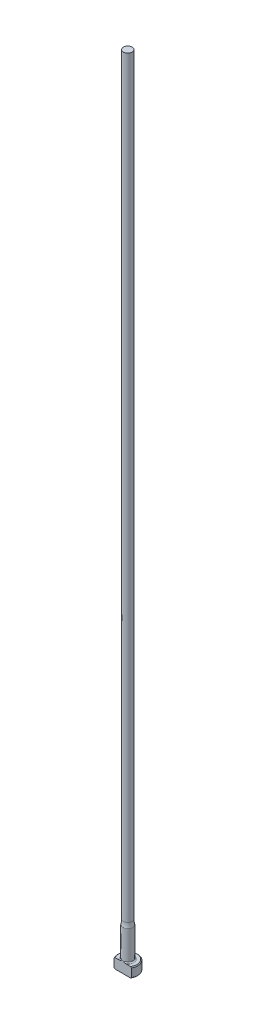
ISO-10303-21;
HEADER;
FILE_DESCRIPTION(('STEP AP214'),'2;1');
FILE_NAME('part.step','',(''),(''),'','','');
FILE_SCHEMA(('AUTOMOTIVE_DESIGN { 1 0 10303 214 1 1 1 1 }'));
ENDSEC;
DATA;
#1=APPLICATION_CONTEXT('core data for automotive mechanical design processes');
#2=APPLICATION_PROTOCOL_DEFINITION('international standard','automotive_design',2000,#1);
#3=PRODUCT_CONTEXT('',#1,'mechanical');
#4=PRODUCT('Part','Part','',(#3));
#5=PRODUCT_RELATED_PRODUCT_CATEGORY('part','',(#4));
#6=PRODUCT_DEFINITION_FORMATION('','',#4);
#7=PRODUCT_DEFINITION_CONTEXT('part definition',#1,'design');
#8=PRODUCT_DEFINITION('design','',#6,#7);
#9=PRODUCT_DEFINITION_SHAPE('','',#8);
#10=(LENGTH_UNIT() NAMED_UNIT(*) SI_UNIT(.MILLI.,.METRE.));
#11=(NAMED_UNIT(*) PLANE_ANGLE_UNIT() SI_UNIT($,.RADIAN.));
#12=(NAMED_UNIT(*) SI_UNIT($,.STERADIAN.) SOLID_ANGLE_UNIT());
#13=UNCERTAINTY_MEASURE_WITH_UNIT(LENGTH_MEASURE(1.E-05),#10,'distance_accuracy_value','');
#14=(GEOMETRIC_REPRESENTATION_CONTEXT(3) GLOBAL_UNCERTAINTY_ASSIGNED_CONTEXT((#13)) GLOBAL_UNIT_ASSIGNED_CONTEXT((#10,
#11,#12)) REPRESENTATION_CONTEXT('',''));
#15=CARTESIAN_POINT('',(0.,0.,0.));
#16=DIRECTION('',(0.,0.,1.));
#17=DIRECTION('',(1.,0.,0.));
#18=AXIS2_PLACEMENT_3D('',#15,#16,#17);
#19=CARTESIAN_POINT('',(-1.38810999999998,254.,0.));
#20=DIRECTION('',(0.,1.,0.));
#21=DIRECTION('',(0.,0.,1.));
#22=AXIS2_PLACEMENT_3D('',#19,#20,#21);
#23=PLANE('',#22);
#24=CARTESIAN_POINT('',(0.,254.,0.));
#25=DIRECTION('',(0.,1.,0.));
#26=DIRECTION('',(0.,0.,1.));
#27=AXIS2_PLACEMENT_3D('',#24,#25,#26);
#28=CIRCLE('',#27,1.38810999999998);
#29=CARTESIAN_POINT('',(0.,254.,1.38810999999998));
#30=VERTEX_POINT('',#29);
#31=EDGE_CURVE('E164',#30,#30,#28,.T.);
#32=ORIENTED_EDGE('',*,*,#31,.T.);
#33=EDGE_LOOP('',(#32));
#34=FACE_BOUND('',#33,.T.);
#35=ADVANCED_FACE('F32',(#34),#23,.T.);
#36=CARTESIAN_POINT('',(0.,259.958771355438,0.));
#37=DIRECTION('',(0.,1.,0.));
#38=DIRECTION('',(0.,0.,1.));
#39=AXIS2_PLACEMENT_3D('',#36,#37,#38);
#40=CYLINDRICAL_SURFACE('',#39,1.38810999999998);
#41=CARTESIAN_POINT('',(0.,14.2787642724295,0.));
#42=DIRECTION('',(0.,1.,0.));
#43=DIRECTION('',(0.,0.,1.));
#44=AXIS2_PLACEMENT_3D('',#41,#42,#43);
#45=CIRCLE('',#44,1.38810999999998);
#46=CARTESIAN_POINT('',(0.,14.2787642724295,1.38810999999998));
#47=VERTEX_POINT('',#46);
#48=EDGE_CURVE('E167',#47,#47,#45,.T.);
#49=ORIENTED_EDGE('',*,*,#48,.T.);
#50=EDGE_LOOP('',(#49));
#51=FACE_BOUND('',#50,.T.);
#52=ORIENTED_EDGE('',*,*,#31,.F.);
#53=EDGE_LOOP('',(#52));
#54=FACE_BOUND('',#53,.T.);
#55=ADVANCED_FACE('F155',(#51,#54),#40,.T.);
#56=CARTESIAN_POINT('',(0.,14.2787642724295,0.));
#57=DIRECTION('',(0.,1.,0.));
#58=DIRECTION('',(0.,0.,1.));
#59=AXIS2_PLACEMENT_3D('',#56,#57,#58);
#60=TOROIDAL_SURFACE('',#59,7.73810999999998,6.35);
#61=CARTESIAN_POINT('',(0.,12.7,0.));
#62=DIRECTION('',(0.,1.,0.));
#63=DIRECTION('',(0.,0.,1.));
#64=AXIS2_PLACEMENT_3D('',#61,#62,#63);
#65=CIRCLE('',#64,1.58749999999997);
#66=CARTESIAN_POINT('',(0.,12.7,1.58749999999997));
#67=VERTEX_POINT('',#66);
#68=EDGE_CURVE('E95',#67,#67,#65,.T.);
#69=ORIENTED_EDGE('',*,*,#68,.T.);
#70=EDGE_LOOP('',(#69));
#71=FACE_BOUND('',#70,.T.);
#72=ORIENTED_EDGE('',*,*,#48,.F.);
#73=EDGE_LOOP('',(#72));
#74=FACE_BOUND('',#73,.T.);
#75=ADVANCED_FACE('F160',(#71,#74),#60,.F.);
#76=CARTESIAN_POINT('',(0.,259.958771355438,0.));
#77=DIRECTION('',(0.,1.,0.));
#78=DIRECTION('',(0.,0.,1.));
#79=AXIS2_PLACEMENT_3D('',#76,#77,#78);
#80=CYLINDRICAL_SURFACE('',#79,1.58749999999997);
#81=CARTESIAN_POINT('',(0.,3.556,0.));
#82=DIRECTION('',(0.,1.,0.));
#83=DIRECTION('',(0.,0.,1.));
#84=AXIS2_PLACEMENT_3D('',#81,#82,#83);
#85=CIRCLE('',#84,1.58749999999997);
#86=CARTESIAN_POINT('',(0.,3.556,1.58749999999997));
#87=VERTEX_POINT('',#86);
#88=EDGE_CURVE('E104',#87,#87,#85,.T.);
#89=ORIENTED_EDGE('',*,*,#88,.T.);
#90=EDGE_LOOP('',(#89));
#91=FACE_BOUND('',#90,.T.);
#92=ORIENTED_EDGE('',*,*,#68,.F.);
#93=EDGE_LOOP('',(#92));
#94=FACE_BOUND('',#93,.T.);
#95=ADVANCED_FACE('F187',(#91,#94),#80,.T.);
#96=CARTESIAN_POINT('',(-3.17499999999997,3.175,0.));
#97=DIRECTION('',(0.,1.,0.));
#98=DIRECTION('',(0.,0.,1.));
#99=AXIS2_PLACEMENT_3D('',#96,#97,#98);
#100=PLANE('',#99);
#101=DIRECTION('',(-1.,0.,0.));
#102=VECTOR('',#101,1.);
#103=CARTESIAN_POINT('',(-3.17499999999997,3.175,1.58749999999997));
#104=LINE('',#103,#102);
#105=CARTESIAN_POINT('',(2.45195529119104,3.175,1.58749999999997));
#106=VERTEX_POINT('',#105);
#107=CARTESIAN_POINT('',(1.16397422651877,3.175,1.58749999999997));
#108=VERTEX_POINT('',#107);
#109=EDGE_CURVE('E53',#106,#108,#104,.T.);
#110=ORIENTED_EDGE('',*,*,#109,.F.);
#111=CARTESIAN_POINT('',(0.,3.175,0.));
#112=DIRECTION('',(0.,1.,0.));
#113=DIRECTION('',(0.,0.,1.));
#114=AXIS2_PLACEMENT_3D('',#111,#112,#113);
#115=CIRCLE('',#114,2.92099999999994);
#116=CARTESIAN_POINT('',(-2.45195529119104,3.175,1.58749999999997));
#117=VERTEX_POINT('',#116);
#118=EDGE_CURVE('E166',#106,#117,#115,.T.);
#119=ORIENTED_EDGE('',*,*,#118,.T.);
#120=CARTESIAN_POINT('',(-1.16397422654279,3.175,1.58749999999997));
#121=VERTEX_POINT('',#120);
#122=EDGE_CURVE('E135',#121,#117,#104,.T.);
#123=ORIENTED_EDGE('',*,*,#122,.F.);
#124=CARTESIAN_POINT('',(0.,3.175,0.));
#125=DIRECTION('',(0.,1.,0.));
#126=DIRECTION('',(0.,0.,1.));
#127=AXIS2_PLACEMENT_3D('',#124,#125,#126);
#128=CIRCLE('',#127,1.96849999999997);
#129=EDGE_CURVE('E108',#121,#108,#128,.F.);
#130=ORIENTED_EDGE('',*,*,#129,.T.);
#131=EDGE_LOOP('',(#110,#119,#123,#130));
#132=FACE_BOUND('',#131,.T.);
#133=ADVANCED_FACE('F184',(#132),#100,.T.);
#134=CARTESIAN_POINT('',(0.,259.958771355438,0.));
#135=DIRECTION('',(0.,1.,0.));
#136=DIRECTION('',(0.,0.,1.));
#137=AXIS2_PLACEMENT_3D('',#134,#135,#136);
#138=CYLINDRICAL_SURFACE('',#137,3.17499999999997);
#139=DIRECTION('',(0.,-1.,0.));
#140=VECTOR('',#139,1.);
#141=CARTESIAN_POINT('',(-2.74963065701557,254.,1.58749999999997));
#142=LINE('',#141,#140);
#143=CARTESIAN_POINT('',(-2.74963065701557,2.92100000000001,1.58749999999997));
#144=VERTEX_POINT('',#143);
#145=CARTESIAN_POINT('',(-2.74963065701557,0.253999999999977,1.58749999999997));
#146=VERTEX_POINT('',#145);
#147=EDGE_CURVE('E90',#144,#146,#142,.T.);
#148=ORIENTED_EDGE('',*,*,#147,.F.);
#149=CARTESIAN_POINT('',(0.,2.92100000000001,0.));
#150=DIRECTION('',(0.,1.,0.));
#151=DIRECTION('',(0.,0.,1.));
#152=AXIS2_PLACEMENT_3D('',#149,#150,#151);
#153=CIRCLE('',#152,3.17499999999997);
#154=CARTESIAN_POINT('',(2.74963065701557,2.92100000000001,1.58749999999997));
#155=VERTEX_POINT('',#154);
#156=EDGE_CURVE('E105',#144,#155,#153,.F.);
#157=ORIENTED_EDGE('',*,*,#156,.T.);
#158=DIRECTION('',(0.,-1.,0.));
#159=VECTOR('',#158,1.);
#160=CARTESIAN_POINT('',(2.74963065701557,254.,1.58749999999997));
#161=LINE('',#160,#159);
#162=CARTESIAN_POINT('',(2.74963065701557,0.253999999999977,1.58749999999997));
#163=VERTEX_POINT('',#162);
#164=EDGE_CURVE('E177',#155,#163,#161,.T.);
#165=ORIENTED_EDGE('',*,*,#164,.T.);
#166=CARTESIAN_POINT('',(0.,0.253999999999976,0.));
#167=DIRECTION('',(0.,-1.,0.));
#168=DIRECTION('',(0.,0.,-1.));
#169=AXIS2_PLACEMENT_3D('',#166,#167,#168);
#170=CIRCLE('',#169,3.17499999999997);
#171=EDGE_CURVE('E111',#163,#146,#170,.F.);
#172=ORIENTED_EDGE('',*,*,#171,.T.);
#173=EDGE_LOOP('',(#148,#157,#165,#172));
#174=FACE_BOUND('',#173,.T.);
#175=ADVANCED_FACE('F175',(#174),#138,.T.);
#176=CARTESIAN_POINT('',(0.,0.,0.));
#177=DIRECTION('',(0.,-1.,0.));
#178=DIRECTION('',(0.,0.,-1.));
#179=AXIS2_PLACEMENT_3D('',#176,#177,#178);
#180=PLANE('',#179);
#181=DIRECTION('',(1.,0.,0.));
#182=VECTOR('',#181,1.);
#183=CARTESIAN_POINT('',(-2.74963065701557,0.,1.58749999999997));
#184=LINE('',#183,#182);
#185=CARTESIAN_POINT('',(-2.45195529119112,0.,1.58749999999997));
#186=VERTEX_POINT('',#185);
#187=CARTESIAN_POINT('',(2.45195529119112,0.,1.58749999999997));
#188=VERTEX_POINT('',#187);
#189=EDGE_CURVE('E87',#186,#188,#184,.T.);
#190=ORIENTED_EDGE('',*,*,#189,.F.);
#191=CARTESIAN_POINT('',(0.,0.,0.));
#192=DIRECTION('',(0.,-1.,0.));
#193=DIRECTION('',(0.,0.,-1.));
#194=AXIS2_PLACEMENT_3D('',#191,#192,#193);
#195=CIRCLE('',#194,2.92100000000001);
#196=EDGE_CURVE('E101',#186,#188,#195,.T.);
#197=ORIENTED_EDGE('',*,*,#196,.T.);
#198=EDGE_LOOP('',(#190,#197));
#199=FACE_BOUND('',#198,.T.);
#200=ADVANCED_FACE('F100',(#199),#180,.T.);
#201=CARTESIAN_POINT('',(0.,3.17499999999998,0.));
#202=DIRECTION('',(0.,-1.,0.));
#203=DIRECTION('',(0.,0.,-1.));
#204=AXIS2_PLACEMENT_3D('',#201,#202,#203);
#205=CONICAL_SURFACE('',#204,2.92099999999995,0.785398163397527);
#206=CARTESIAN_POINT('',(6.0529050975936,-0.16162066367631,1.58749999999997));
#207=CARTESIAN_POINT('',(5.91567682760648,-0.0288893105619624,1.58749999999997));
#208=CARTESIAN_POINT('',(5.7783103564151,0.103699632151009,1.58749999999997));
#209=CARTESIAN_POINT('',(5.50321874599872,0.368508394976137,1.58749999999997));
#210=CARTESIAN_POINT('',(5.36549360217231,0.500728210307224,1.58749999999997));
#211=CARTESIAN_POINT('',(5.08953516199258,0.764778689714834,1.58749999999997));
#212=CARTESIAN_POINT('',(4.9513016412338,0.896609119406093,1.58749999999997));
#213=CARTESIAN_POINT('',(4.67428233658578,1.15968706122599,1.58749999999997));
#214=CARTESIAN_POINT('',(4.53549655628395,1.29093457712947,1.58749999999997));
#215=CARTESIAN_POINT('',(4.25997724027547,1.55007705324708,1.58749999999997));
#216=CARTESIAN_POINT('',(4.12325766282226,1.67798684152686,1.58749999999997));
#217=CARTESIAN_POINT('',(3.84892898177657,1.9328486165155,1.58749999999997));
#218=CARTESIAN_POINT('',(3.71131988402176,2.05980060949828,1.58749999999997));
#219=CARTESIAN_POINT('',(3.43493978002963,2.31237508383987,1.58749999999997));
#220=CARTESIAN_POINT('',(3.29616903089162,2.43799784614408,1.58749999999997));
#221=CARTESIAN_POINT('',(3.01699558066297,2.68741369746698,1.58749999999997));
#222=CARTESIAN_POINT('',(2.8765929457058,2.81120686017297,1.58749999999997));
#223=CARTESIAN_POINT('',(2.64816703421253,3.00875865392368,1.58749999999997));
#224=CARTESIAN_POINT('',(2.56087478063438,3.08336151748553,1.58749999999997));
#225=CARTESIAN_POINT('',(2.38515423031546,3.23123871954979,1.58749999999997));
#226=CARTESIAN_POINT('',(2.29672582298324,3.30451292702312,1.58749999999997));
#227=CARTESIAN_POINT('',(2.11747400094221,3.45004422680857,1.58749999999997));
#228=CARTESIAN_POINT('',(2.02663514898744,3.5222823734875,1.58749999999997));
#229=CARTESIAN_POINT('',(1.8430252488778,3.66423097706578,1.58749999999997));
#230=CARTESIAN_POINT('',(1.75025467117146,3.73394203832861,1.58749999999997));
#231=CARTESIAN_POINT('',(1.56067475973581,3.87080633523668,1.58749999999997));
#232=CARTESIAN_POINT('',(1.46382547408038,3.93790459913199,1.58749999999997));
#233=CARTESIAN_POINT('',(1.26632594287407,4.06669147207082,1.58749999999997));
#234=CARTESIAN_POINT('',(1.16567073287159,4.1283726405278,1.58749999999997));
#235=CARTESIAN_POINT('',(1.01165766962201,4.21402252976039,1.58749999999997));
#236=CARTESIAN_POINT('',(0.960142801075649,4.24127929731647,1.58749999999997));
#237=CARTESIAN_POINT('',(0.855780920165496,4.2930979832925,1.58749999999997));
#238=CARTESIAN_POINT('',(0.80293366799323,4.31765941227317,1.58749999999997));
#239=CARTESIAN_POINT('',(0.642461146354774,4.38614656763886,1.58749999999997));
#240=CARTESIAN_POINT('',(0.532518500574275,4.42510149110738,1.58749999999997));
#241=CARTESIAN_POINT('',(0.367680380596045,4.46726244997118,1.58749999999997));
#242=CARTESIAN_POINT('',(0.31480288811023,4.47844427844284,1.58749999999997));
#243=CARTESIAN_POINT('',(0.208209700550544,4.49576654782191,1.58749999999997));
#244=CARTESIAN_POINT('',(0.154494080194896,4.50190743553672,1.58749999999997));
#245=CARTESIAN_POINT('',(0.0468792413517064,4.50871296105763,1.58749999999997));
#246=CARTESIAN_POINT('',(-0.0070188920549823,4.5093945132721,1.58749999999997));
#247=CARTESIAN_POINT('',(-0.114606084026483,4.50527679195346,1.58749999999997));
#248=CARTESIAN_POINT('',(-0.168295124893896,4.50047706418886,1.58749999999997));
#249=CARTESIAN_POINT('',(-0.274485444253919,4.48579689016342,1.58749999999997));
#250=CARTESIAN_POINT('',(-0.326992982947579,4.47596081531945,1.58749999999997));
#251=CARTESIAN_POINT('',(-0.430974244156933,4.45181809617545,1.58749999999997));
#252=CARTESIAN_POINT('',(-0.482447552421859,4.4375096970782,1.58749999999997));
#253=CARTESIAN_POINT('',(-0.584460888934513,4.40502489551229,1.58749999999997));
#254=CARTESIAN_POINT('',(-0.634994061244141,4.386827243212,1.58749999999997));
#255=CARTESIAN_POINT('',(-0.734789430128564,4.34729308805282,1.58749999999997));
#256=CARTESIAN_POINT('',(-0.784051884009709,4.3259572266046,1.58749999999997));
#257=CARTESIAN_POINT('',(-0.930549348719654,4.25791922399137,1.58749999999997));
#258=CARTESIAN_POINT('',(-1.0259880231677,4.20736047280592,1.58749999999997));
#259=CARTESIAN_POINT('',(-1.21304313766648,4.0995545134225,1.58749999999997));
#260=CARTESIAN_POINT('',(-1.30465471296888,4.04229912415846,1.58749999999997));
#261=CARTESIAN_POINT('',(-1.48526211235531,3.92308746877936,1.58749999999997));
#262=CARTESIAN_POINT('',(-1.57424615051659,3.86111349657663,1.58749999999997));
#263=CARTESIAN_POINT('',(-1.74990003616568,3.73408621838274,1.58749999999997));
#264=CARTESIAN_POINT('',(-1.83657099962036,3.66903444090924,1.58749999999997));
#265=CARTESIAN_POINT('',(-2.00931764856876,3.53583371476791,1.58749999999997));
#266=CARTESIAN_POINT('',(-2.09537048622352,3.46765527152,1.58749999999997));
#267=CARTESIAN_POINT('',(-2.26611736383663,3.32960643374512,1.58749999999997));
#268=CARTESIAN_POINT('',(-2.35081125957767,3.25973586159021,1.58749999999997));
#269=CARTESIAN_POINT('',(-2.60290121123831,3.04858139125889,1.58749999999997));
#270=CARTESIAN_POINT('',(-2.76872537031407,2.90542388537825,1.58749999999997));
#271=CARTESIAN_POINT('',(-3.06970913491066,2.64069522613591,1.58749999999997));
#272=CARTESIAN_POINT('',(-3.20528660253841,2.51959458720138,1.58749999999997));
#273=CARTESIAN_POINT('',(-3.47510321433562,2.27590400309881,1.58749999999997));
#274=CARTESIAN_POINT('',(-3.60934232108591,2.1533140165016,1.58749999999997));
#275=CARTESIAN_POINT('',(-3.87695374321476,1.90694239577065,1.58749999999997));
#276=CARTESIAN_POINT('',(-4.0103251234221,1.78315974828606,1.58749999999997));
#277=CARTESIAN_POINT('',(-4.27630880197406,1.53478104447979,1.58749999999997));
#278=CARTESIAN_POINT('',(-4.40892109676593,1.41018498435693,1.58749999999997));
#279=CARTESIAN_POINT('',(-4.79499418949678,1.0457468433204,1.58749999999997));
#280=CARTESIAN_POINT('',(-5.04767313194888,0.805076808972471,1.58749999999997));
#281=CARTESIAN_POINT('',(-5.42550911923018,0.443121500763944,1.58749999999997));
#282=CARTESIAN_POINT('',(-5.55118772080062,0.322378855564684,1.58749999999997));
#283=CARTESIAN_POINT('',(-5.80225207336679,0.0805914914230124,1.58749999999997));
#284=CARTESIAN_POINT('',(-5.92763782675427,-0.0404532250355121,1.58749999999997));
#285=CARTESIAN_POINT('',(-6.0529050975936,-0.161620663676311,1.58749999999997));
#286=B_SPLINE_CURVE_WITH_KNOTS('',3,(#206,#207,#208,#209,#210,#211,#212,#213,#214,#215,#216,
#217,#218,#219,#220,#221,#222,#223,#224,#225,#226,#227,#228,#229,#230,#231,#232,#233,#234,#235,
#236,#237,#238,#239,#240,#241,#242,#243,#244,#245,#246,#247,#248,#249,#250,#251,#252,#253,#254,
#255,#256,#257,#258,#259,#260,#261,#262,#263,#264,#265,#266,#267,#268,#269,#270,#271,#272,#273,
#274,#275,#276,#277,#278,#279,#280,#281,#282,#283,#284,#285),.UNSPECIFIED.,.F.,.F.,(4,2,2,2,2,2,
2,2,2,2,2,2,2,2,2,2,2,2,2,2,2,2,2,2,2,2,2,2,2,2,2,2,2,2,2,2,2,2,2,4),(0.,0.572750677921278,
1.14550874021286,1.71856057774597,2.29160869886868,2.85328006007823,3.4149477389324,
3.97649423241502,4.53801804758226,4.88249307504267,5.22700189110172,5.5751532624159,
5.92322081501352,6.27657800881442,6.63041319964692,6.80518126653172,6.9799810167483,
7.3282426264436,7.49018491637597,7.65211285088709,7.81353889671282,7.97497832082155,
8.13501929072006,8.29512313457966,8.45612518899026,8.61709438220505,8.94062993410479,
9.2645649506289,9.58978187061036,9.91483894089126,10.2441741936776,10.5735441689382,
11.2306812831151,11.7760337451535,12.3214014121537,12.8672825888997,13.4131663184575,
14.4600164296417,14.9828595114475,15.5056983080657),.UNSPECIFIED.);
#287=EDGE_CURVE('E58',#155,#106,#286,.T.);
#288=ORIENTED_EDGE('',*,*,#287,.F.);
#289=ORIENTED_EDGE('',*,*,#156,.F.);
#290=EDGE_CURVE('E128',#117,#144,#286,.T.);
#291=ORIENTED_EDGE('',*,*,#290,.F.);
#292=ORIENTED_EDGE('',*,*,#118,.F.);
#293=EDGE_LOOP('',(#288,#289,#291,#292));
#294=FACE_BOUND('',#293,.T.);
#295=ADVANCED_FACE('F142',(#294),#205,.T.);
#296=CARTESIAN_POINT('',(0.,0.253999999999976,0.));
#297=DIRECTION('',(0.,1.,0.));
#298=DIRECTION('',(0.,0.,1.));
#299=AXIS2_PLACEMENT_3D('',#296,#297,#298);
#300=CONICAL_SURFACE('',#299,3.17499999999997,0.785398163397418);
#301=CARTESIAN_POINT('',(-6.0529050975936,3.33662066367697,1.58749999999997));
#302=CARTESIAN_POINT('',(-5.91567682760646,3.20388931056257,1.58749999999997));
#303=CARTESIAN_POINT('',(-5.77831035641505,3.07130036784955,1.58749999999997));
#304=CARTESIAN_POINT('',(-5.50321874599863,2.80649160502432,1.58749999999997));
#305=CARTESIAN_POINT('',(-5.3654936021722,2.67427178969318,1.58749999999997));
#306=CARTESIAN_POINT('',(-5.08953516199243,2.41022131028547,1.58749999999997));
#307=CARTESIAN_POINT('',(-4.95130164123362,2.27839088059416,1.58749999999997));
#308=CARTESIAN_POINT('',(-4.67428233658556,2.01531293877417,1.58749999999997));
#309=CARTESIAN_POINT('',(-4.5354965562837,1.88406542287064,1.58749999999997));
#310=CARTESIAN_POINT('',(-4.25997724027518,1.62492294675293,1.58749999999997));
#311=CARTESIAN_POINT('',(-4.12325766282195,1.49701315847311,1.58749999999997));
#312=CARTESIAN_POINT('',(-3.84892898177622,1.24215138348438,1.58749999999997));
#313=CARTESIAN_POINT('',(-3.71131988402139,1.11519939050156,1.58749999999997));
#314=CARTESIAN_POINT('',(-3.43493978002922,0.862624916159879,1.58749999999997));
#315=CARTESIAN_POINT('',(-3.29616903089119,0.737002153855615,1.58749999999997));
#316=CARTESIAN_POINT('',(-3.01699558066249,0.487586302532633,1.58749999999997));
#317=CARTESIAN_POINT('',(-2.8765929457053,0.363793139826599,1.58749999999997));
#318=CARTESIAN_POINT('',(-2.64816703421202,0.166241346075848,1.58749999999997));
#319=CARTESIAN_POINT('',(-2.56087478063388,0.0916384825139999,1.58749999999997));
#320=CARTESIAN_POINT('',(-2.385154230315,-0.0562387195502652,1.58749999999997));
#321=CARTESIAN_POINT('',(-2.29672582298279,-0.129512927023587,1.58749999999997));
#322=CARTESIAN_POINT('',(-2.11747400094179,-0.275044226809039,1.58749999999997));
#323=CARTESIAN_POINT('',(-2.02663514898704,-0.347282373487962,1.58749999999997));
#324=CARTESIAN_POINT('',(-1.84302524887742,-0.489230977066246,1.58749999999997));
#325=CARTESIAN_POINT('',(-1.7502546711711,-0.558942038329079,1.58749999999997));
#326=CARTESIAN_POINT('',(-1.56067475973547,-0.695806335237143,1.58749999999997));
#327=CARTESIAN_POINT('',(-1.46382547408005,-0.762904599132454,1.58749999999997));
#328=CARTESIAN_POINT('',(-1.26632594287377,-0.891691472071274,1.58749999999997));
#329=CARTESIAN_POINT('',(-1.16567073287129,-0.953372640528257,1.58749999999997));
#330=CARTESIAN_POINT('',(-1.01165766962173,-1.03902252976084,1.58749999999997));
#331=CARTESIAN_POINT('',(-0.960142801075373,-1.06627929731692,1.58749999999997));
#332=CARTESIAN_POINT('',(-0.85578092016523,-1.11809798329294,1.58749999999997));
#333=CARTESIAN_POINT('',(-0.802933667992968,-1.14265941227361,1.58749999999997));
#334=CARTESIAN_POINT('',(-0.642461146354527,-1.21114656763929,1.58749999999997));
#335=CARTESIAN_POINT('',(-0.532518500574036,-1.2501014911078,1.58749999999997));
#336=CARTESIAN_POINT('',(-0.367680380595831,-1.29226244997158,1.58749999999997));
#337=CARTESIAN_POINT('',(-0.314802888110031,-1.30344427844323,1.58749999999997));
#338=CARTESIAN_POINT('',(-0.208209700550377,-1.32076654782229,1.58749999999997));
#339=CARTESIAN_POINT('',(-0.154494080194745,-1.3269074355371,1.58749999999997));
#340=CARTESIAN_POINT('',(-0.0468792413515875,-1.333712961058,1.58749999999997));
#341=CARTESIAN_POINT('',(0.00701889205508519,-1.33439451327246,1.58749999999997));
#342=CARTESIAN_POINT('',(0.114606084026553,-1.33027679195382,1.58749999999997));
#343=CARTESIAN_POINT('',(0.16829512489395,-1.32547706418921,1.58749999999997));
#344=CARTESIAN_POINT('',(0.274485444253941,-1.31079689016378,1.58749999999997));
#345=CARTESIAN_POINT('',(0.326992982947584,-1.3009608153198,1.58749999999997));
#346=CARTESIAN_POINT('',(0.430974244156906,-1.27681809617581,1.58749999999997));
#347=CARTESIAN_POINT('',(0.482447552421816,-1.26250969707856,1.58749999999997));
#348=CARTESIAN_POINT('',(0.584460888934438,-1.23002489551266,1.58749999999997));
#349=CARTESIAN_POINT('',(0.634994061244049,-1.21182724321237,1.58749999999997));
#350=CARTESIAN_POINT('',(0.734789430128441,-1.1722930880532,1.58749999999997));
#351=CARTESIAN_POINT('',(0.784051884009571,-1.15095722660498,1.58749999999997));
#352=CARTESIAN_POINT('',(0.93054934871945,-1.08291922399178,1.58749999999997));
#353=CARTESIAN_POINT('',(1.02598802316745,-1.03236047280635,1.58749999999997));
#354=CARTESIAN_POINT('',(1.21304313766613,-0.924554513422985,1.58749999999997));
#355=CARTESIAN_POINT('',(1.30465471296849,-0.86729912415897,1.58749999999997));
#356=CARTESIAN_POINT('',(1.48526211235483,-0.748087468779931,1.58749999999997));
#357=CARTESIAN_POINT('',(1.57424615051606,-0.686113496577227,1.58749999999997));
#358=CARTESIAN_POINT('',(1.74990003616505,-0.559086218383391,1.58749999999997));
#359=CARTESIAN_POINT('',(1.83657099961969,-0.494034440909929,1.58749999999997));
#360=CARTESIAN_POINT('',(2.009317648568,-0.360833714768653,1.58749999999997));
#361=CARTESIAN_POINT('',(2.09537048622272,-0.292655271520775,1.58749999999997));
#362=CARTESIAN_POINT('',(2.26611736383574,-0.154606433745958,1.58749999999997));
#363=CARTESIAN_POINT('',(2.35081125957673,-0.0847358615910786,1.58749999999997));
#364=CARTESIAN_POINT('',(2.60290121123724,0.126418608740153,1.58749999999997));
#365=CARTESIAN_POINT('',(2.7687253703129,0.269576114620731,1.58749999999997));
#366=CARTESIAN_POINT('',(3.06970913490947,0.534304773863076,1.58749999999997));
#367=CARTESIAN_POINT('',(3.20528660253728,0.65540541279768,1.58749999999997));
#368=CARTESIAN_POINT('',(3.47510321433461,0.899095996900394,1.58749999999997));
#369=CARTESIAN_POINT('',(3.60934232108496,1.02168598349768,1.58749999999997));
#370=CARTESIAN_POINT('',(3.87695374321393,1.26805760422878,1.58749999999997));
#371=CARTESIAN_POINT('',(4.01032512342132,1.39184025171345,1.58749999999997));
#372=CARTESIAN_POINT('',(4.2763088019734,1.64021895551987,1.58749999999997));
#373=CARTESIAN_POINT('',(4.40892109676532,1.76481501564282,1.58749999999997));
#374=CARTESIAN_POINT('',(4.79499418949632,2.12925315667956,1.58749999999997));
#375=CARTESIAN_POINT('',(5.04767313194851,2.36992319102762,1.58749999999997));
#376=CARTESIAN_POINT('',(5.42550911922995,2.73187849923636,1.58749999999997));
#377=CARTESIAN_POINT('',(5.55118772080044,2.85262114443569,1.58749999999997));
#378=CARTESIAN_POINT('',(5.8022520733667,3.0944085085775,1.58749999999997));
#379=CARTESIAN_POINT('',(5.92763782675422,3.2154532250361,1.58749999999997));
#380=CARTESIAN_POINT('',(6.0529050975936,3.33662066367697,1.58749999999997));
#381=B_SPLINE_CURVE_WITH_KNOTS('',3,(#301,#302,#303,#304,#305,#306,#307,#308,#309,#310,#311,
#312,#313,#314,#315,#316,#317,#318,#319,#320,#321,#322,#323,#324,#325,#326,#327,#328,#329,#330,
#331,#332,#333,#334,#335,#336,#337,#338,#339,#340,#341,#342,#343,#344,#345,#346,#347,#348,#349,
#350,#351,#352,#353,#354,#355,#356,#357,#358,#359,#360,#361,#362,#363,#364,#365,#366,#367,#368,
#369,#370,#371,#372,#373,#374,#375,#376,#377,#378,#379,#380),.UNSPECIFIED.,.F.,.F.,(4,2,2,2,2,2,
2,2,2,2,2,2,2,2,2,2,2,2,2,2,2,2,2,2,2,2,2,2,2,2,2,2,2,2,2,2,2,2,2,4),(0.,0.57275067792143,
1.14550874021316,1.71856057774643,2.29160869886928,2.85328006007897,3.41494773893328,
3.97649423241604,4.53801804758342,4.88249307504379,5.2270018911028,5.57515326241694,
5.92322081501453,6.27657800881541,6.63041319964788,6.80518126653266,6.97998101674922,
7.32824262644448,7.49018491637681,7.65211285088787,7.81353889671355,7.97497832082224,
8.1350192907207,8.29512313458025,8.4561251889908,8.61709438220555,8.94062993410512,
9.26456495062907,9.58978187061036,9.91483894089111,10.2441741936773,10.5735441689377,
11.2306812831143,11.7760337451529,12.3214014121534,12.8672825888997,13.4131663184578,
14.4600164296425,14.9828595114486,15.505698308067),.UNSPECIFIED.);
#382=EDGE_CURVE('E84',#146,#186,#381,.T.);
#383=ORIENTED_EDGE('',*,*,#382,.F.);
#384=ORIENTED_EDGE('',*,*,#171,.F.);
#385=EDGE_CURVE('E96',#188,#163,#381,.T.);
#386=ORIENTED_EDGE('',*,*,#385,.F.);
#387=ORIENTED_EDGE('',*,*,#196,.F.);
#388=EDGE_LOOP('',(#383,#384,#386,#387));
#389=FACE_BOUND('',#388,.T.);
#390=ADVANCED_FACE('F103',(#389),#300,.T.);
#391=CARTESIAN_POINT('',(0.,3.556,0.));
#392=DIRECTION('',(0.,1.,0.));
#393=DIRECTION('',(0.,0.,1.));
#394=AXIS2_PLACEMENT_3D('',#391,#392,#393);
#395=TOROIDAL_SURFACE('',#394,1.96849999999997,0.381);
#396=ORIENTED_EDGE('',*,*,#129,.F.);
#397=CARTESIAN_POINT('',(0.,3.556,1.58749999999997));
#398=CARTESIAN_POINT('',(-9.72836884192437E-12,3.55600071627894,1.58749999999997));
#399=CARTESIAN_POINT('',(-1.16390046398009E-07,3.55600143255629,1.58749999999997));
#400=CARTESIAN_POINT('',(-5.02802246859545E-07,3.55600282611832,1.58749999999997));
#401=CARTESIAN_POINT('',(-7.75049107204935E-07,3.55600350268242,1.58749999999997));
#402=CARTESIAN_POINT('',(-1.43578184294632E-06,3.5560048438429,1.58749999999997));
#403=CARTESIAN_POINT('',(-1.83004114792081E-06,3.55600550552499,1.58749999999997));
#404=CARTESIAN_POINT('',(-2.69326522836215E-06,3.55600677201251,1.58749999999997));
#405=CARTESIAN_POINT('',(-3.16190626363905E-06,3.55600737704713,1.58749999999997));
#406=CARTESIAN_POINT('',(-4.80183829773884E-06,3.55600933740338,1.58749999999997));
#407=CARTESIAN_POINT('',(-6.07237544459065E-06,3.55601061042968,1.58749999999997));
#408=CARTESIAN_POINT('',(-8.74131689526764E-06,3.55601293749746,1.58749999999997));
#409=CARTESIAN_POINT('',(-1.01362053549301E-05,3.5560139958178,1.58749999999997));
#410=CARTESIAN_POINT('',(-1.54025643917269E-05,3.55601779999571,1.58749999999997));
#411=CARTESIAN_POINT('',(-1.94297991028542E-05,3.55602033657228,1.58749999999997));
#412=CARTESIAN_POINT('',(-2.75116573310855E-05,3.55602464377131,1.58749999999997));
#413=CARTESIAN_POINT('',(-3.15456372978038E-05,3.5560264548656,1.58749999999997));
#414=CARTESIAN_POINT('',(-4.82039074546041E-05,3.55603383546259,1.58749999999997));
#415=CARTESIAN_POINT('',(-6.08993135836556E-05,3.55603922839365,1.58749999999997));
#416=CARTESIAN_POINT('',(-8.49758222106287E-05,3.55604818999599,1.58749999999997));
#417=CARTESIAN_POINT('',(-9.62998308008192E-05,3.55605190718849,1.58749999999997));
#418=CARTESIAN_POINT('',(-0.000176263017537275,3.55608045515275,1.58749999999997));
#419=CARTESIAN_POINT('',(-0.000240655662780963,3.55611569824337,1.58749999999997));
#420=CARTESIAN_POINT('',(-0.000487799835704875,3.55624580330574,1.58749999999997));
#421=CARTESIAN_POINT('',(-0.000673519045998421,3.55633293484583,1.58749999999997));
#422=CARTESIAN_POINT('',(-0.00138308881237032,3.55667103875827,1.58749999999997));
#423=CARTESIAN_POINT('',(-0.00190387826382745,3.55693009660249,1.58749999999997));
#424=CARTESIAN_POINT('',(-0.00399959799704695,3.55796727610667,1.58749999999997));
#425=CARTESIAN_POINT('',(-0.00557790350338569,3.55873636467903,1.58749999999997));
#426=CARTESIAN_POINT('',(-0.0382341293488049,3.57465580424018,1.58749999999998));
#427=CARTESIAN_POINT('',(-0.0692744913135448,3.58990875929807,1.58749999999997));
#428=CARTESIAN_POINT('',(-0.130397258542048,3.61965968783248,1.58749999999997));
#429=CARTESIAN_POINT('',(-0.160476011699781,3.63416561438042,1.58749999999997));
#430=CARTESIAN_POINT('',(-0.224053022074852,3.66443420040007,1.58749999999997));
#431=CARTESIAN_POINT('',(-0.257567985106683,3.68016231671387,1.58749999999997));
#432=CARTESIAN_POINT('',(-0.32519681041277,3.71115684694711,1.58749999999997));
#433=CARTESIAN_POINT('',(-0.359313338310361,3.72641747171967,1.58749999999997));
#434=CARTESIAN_POINT('',(-0.419670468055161,3.752521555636,1.58749999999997));
#435=CARTESIAN_POINT('',(-0.445832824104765,3.76354497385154,1.58749999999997));
#436=CARTESIAN_POINT('',(-0.498343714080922,3.7849613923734,1.58749999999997));
#437=CARTESIAN_POINT('',(-0.524691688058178,3.79535577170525,1.58749999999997));
#438=CARTESIAN_POINT('',(-0.60309846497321,3.82505921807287,1.58749999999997));
#439=CARTESIAN_POINT('',(-0.655557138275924,3.84334682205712,1.58749999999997));
#440=CARTESIAN_POINT('',(-0.737608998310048,3.86867530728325,1.58749999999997));
#441=CARTESIAN_POINT('',(-0.766787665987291,3.87705653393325,1.58749999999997));
#442=CARTESIAN_POINT('',(-0.825628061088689,3.89250520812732,1.58749999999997));
#443=CARTESIAN_POINT('',(-0.855291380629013,3.89956651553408,1.58749999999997));
#444=CARTESIAN_POINT('',(-0.947623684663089,3.91896724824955,1.58749999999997));
#445=CARTESIAN_POINT('',(-1.01091582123,3.92863515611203,1.58749999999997));
#446=CARTESIAN_POINT('',(-1.1249172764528,3.93735173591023,1.58749999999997));
#447=CARTESIAN_POINT('',(-1.17548103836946,3.93820257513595,1.58749999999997));
#448=CARTESIAN_POINT('',(-1.27560751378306,3.93219174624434,1.58749999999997));
#449=CARTESIAN_POINT('',(-1.32517446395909,3.92543532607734,1.58749999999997));
#450=CARTESIAN_POINT('',(-1.40268723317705,3.90689937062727,1.58749999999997));
#451=CARTESIAN_POINT('',(-1.43136704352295,3.89820069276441,1.58749999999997));
#452=CARTESIAN_POINT('',(-1.48727388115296,3.87676152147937,1.58749999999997));
#453=CARTESIAN_POINT('',(-1.51449910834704,3.86401614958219,1.58749999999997));
#454=CARTESIAN_POINT('',(-1.56082978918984,3.83720110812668,1.58749999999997));
#455=CARTESIAN_POINT('',(-1.58042967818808,3.82399155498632,1.58749999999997));
#456=CARTESIAN_POINT('',(-1.61726850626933,3.79461258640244,1.58749999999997));
#457=CARTESIAN_POINT('',(-1.63451177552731,3.77844873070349,1.58749999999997));
#458=CARTESIAN_POINT('',(-1.66235366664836,3.74697901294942,1.58749999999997));
#459=CARTESIAN_POINT('',(-1.67358404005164,3.73223408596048,1.58749999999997));
#460=CARTESIAN_POINT('',(-1.69348690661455,3.70109350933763,1.58749999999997));
#461=CARTESIAN_POINT('',(-1.70216040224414,3.68469851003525,1.58749999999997));
#462=CARTESIAN_POINT('',(-1.71647536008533,3.65047412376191,1.58749999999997));
#463=CARTESIAN_POINT('',(-1.72209384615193,3.6326349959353,1.58749999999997));
#464=CARTESIAN_POINT('',(-1.72977101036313,3.59620550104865,1.58749999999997));
#465=CARTESIAN_POINT('',(-1.73183223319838,3.57761568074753,1.58749999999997));
#466=CARTESIAN_POINT('',(-1.73220894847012,3.54269507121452,1.58749999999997));
#467=CARTESIAN_POINT('',(-1.73095378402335,3.52636752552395,1.58749999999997));
#468=CARTESIAN_POINT('',(-1.72566824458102,3.49417280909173,1.58749999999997));
#469=CARTESIAN_POINT('',(-1.72163817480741,3.47830558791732,1.58749999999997));
#470=CARTESIAN_POINT('',(-1.71112762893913,3.44769086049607,1.58749999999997));
#471=CARTESIAN_POINT('',(-1.70468621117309,3.43292978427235,1.58749999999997));
#472=CARTESIAN_POINT('',(-1.68967506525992,3.40454102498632,1.58749999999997));
#473=CARTESIAN_POINT('',(-1.68110458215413,3.39091374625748,1.58749999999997));
#474=CARTESIAN_POINT('',(-1.65863209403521,3.36009164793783,1.58749999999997));
#475=CARTESIAN_POINT('',(-1.64393589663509,3.34347475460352,1.58749999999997));
#476=CARTESIAN_POINT('',(-1.61203006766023,3.31284923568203,1.58749999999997));
#477=CARTESIAN_POINT('',(-1.59481484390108,3.298846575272,1.58749999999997));
#478=CARTESIAN_POINT('',(-1.55180967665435,3.26864697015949,1.58749999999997));
#479=CARTESIAN_POINT('',(-1.52522183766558,3.25359002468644,1.58749999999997));
#480=CARTESIAN_POINT('',(-1.47008223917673,3.22790710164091,1.58749999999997));
#481=CARTESIAN_POINT('',(-1.4415316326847,3.21727854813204,1.58749999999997));
#482=CARTESIAN_POINT('',(-1.36850699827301,3.19543087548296,1.58749999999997));
#483=CARTESIAN_POINT('',(-1.32330828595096,3.18665188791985,1.58749999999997));
#484=CARTESIAN_POINT('',(-1.23163561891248,3.17601019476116,1.58749999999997));
#485=CARTESIAN_POINT('',(-1.1851527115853,3.17423987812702,1.58749999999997));
#486=CARTESIAN_POINT('',(-1.05662630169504,3.17714275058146,1.58749999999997));
#487=CARTESIAN_POINT('',(-0.974728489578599,3.1878188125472,1.58749999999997));
#488=CARTESIAN_POINT('',(-0.855941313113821,3.21210673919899,1.58749999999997));
#489=CARTESIAN_POINT('',(-0.817952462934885,3.22124962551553,1.58749999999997));
#490=CARTESIAN_POINT('',(-0.742758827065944,3.24165077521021,1.58749999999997));
#491=CARTESIAN_POINT('',(-0.705550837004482,3.25289687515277,1.58749999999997));
#492=CARTESIAN_POINT('',(-0.618900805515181,3.28132261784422,1.58749999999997));
#493=CARTESIAN_POINT('',(-0.569693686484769,3.29920707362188,1.58749999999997));
#494=CARTESIAN_POINT('',(-0.496059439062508,3.32795584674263,1.58749999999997));
#495=CARTESIAN_POINT('',(-0.471293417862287,3.33797105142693,1.58749999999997));
#496=CARTESIAN_POINT('',(-0.421913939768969,3.35852833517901,1.58749999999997));
#497=CARTESIAN_POINT('',(-0.397300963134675,3.36907157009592,1.58749999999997));
#498=CARTESIAN_POINT('',(-0.340371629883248,3.39402532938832,1.58749999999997));
#499=CARTESIAN_POINT('',(-0.308122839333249,3.4085893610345,1.58749999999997));
#500=CARTESIAN_POINT('',(-0.244169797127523,3.43810365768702,1.58749999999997));
#501=CARTESIAN_POINT('',(-0.212463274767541,3.45304902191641,1.58749999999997));
#502=CARTESIAN_POINT('',(-0.152300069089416,3.48177412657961,1.58749999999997));
#503=CARTESIAN_POINT('',(-0.123829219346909,3.49552467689,1.58749999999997));
#504=CARTESIAN_POINT('',(-0.0659674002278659,3.5237094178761,1.58749999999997));
#505=CARTESIAN_POINT('',(-0.0365796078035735,3.53815055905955,1.58749999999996));
#506=CARTESIAN_POINT('',(-0.00557801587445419,3.55326358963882,1.58749999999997));
#507=CARTESIAN_POINT('',(-0.00399981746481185,3.55403261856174,1.58749999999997));
#508=CARTESIAN_POINT('',(-0.00190412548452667,3.55506978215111,1.58749999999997));
#509=CARTESIAN_POINT('',(-0.0013832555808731,3.5553288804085,1.58749999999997));
#510=CARTESIAN_POINT('',(-0.00067358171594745,3.55566703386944,1.58749999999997));
#511=CARTESIAN_POINT('',(-0.000487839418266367,3.55575417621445,1.58749999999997));
#512=CARTESIAN_POINT('',(-0.000240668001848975,3.55588429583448,1.58749999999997));
#513=CARTESIAN_POINT('',(-0.000176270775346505,3.55591954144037,1.58749999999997));
#514=CARTESIAN_POINT('',(-9.63021899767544E-05,3.55594809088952,1.58749999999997));
#515=CARTESIAN_POINT('',(-8.49777824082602E-05,3.5559518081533,1.58749999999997));
#516=CARTESIAN_POINT('',(-6.09004214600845E-05,3.55596077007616,1.58749999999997));
#517=CARTESIAN_POINT('',(-4.82045723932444E-05,3.55596616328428,1.58749999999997));
#518=CARTESIAN_POINT('',(-3.15458033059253E-05,3.55597354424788,1.58749999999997));
#519=CARTESIAN_POINT('',(-2.75117551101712E-05,3.55597535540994,1.58749999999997));
#520=CARTESIAN_POINT('',(-1.94297724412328E-05,3.55597966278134,1.58749999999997));
#521=CARTESIAN_POINT('',(-1.5402483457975E-05,3.55598219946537,1.58749999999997));
#522=CARTESIAN_POINT('',(-1.01360754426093E-05,3.55598600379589,1.58749999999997));
#523=CARTESIAN_POINT('',(-8.74118131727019E-06,3.55598706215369,1.58749999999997));
#524=CARTESIAN_POINT('',(-6.07223622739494E-06,3.55598938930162,1.58749999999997));
#525=CARTESIAN_POINT('',(-4.80170134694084E-06,3.55599066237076,1.58749999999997));
#526=CARTESIAN_POINT('',(-3.16178165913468E-06,3.55599262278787,1.58749999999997));
#527=CARTESIAN_POINT('',(-2.69314600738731E-06,3.55599322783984,1.58749999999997));
#528=CARTESIAN_POINT('',(-1.82993575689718E-06,3.55599449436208,1.58749999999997));
#529=CARTESIAN_POINT('',(-1.43568491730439E-06,3.55599515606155,1.58749999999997));
#530=CARTESIAN_POINT('',(-7.74972780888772E-07,3.55599649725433,1.58749999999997));
#531=CARTESIAN_POINT('',(-5.02737766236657E-07,3.55599717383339,1.58749999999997));
#532=CARTESIAN_POINT('',(-1.16354058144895E-07,3.55599856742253,1.58749999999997));
#533=CARTESIAN_POINT('',(9.72849112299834E-12,3.55599928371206,1.58749999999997));
#534=CARTESIAN_POINT('',(0.,3.556,1.58749999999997));
#535=B_SPLINE_CURVE_WITH_KNOTS('',3,(#397,#398,#399,#400,#401,#402,#403,#404,#405,#406,#407,
#408,#409,#410,#411,#412,#413,#414,#415,#416,#417,#418,#419,#420,#421,#422,#423,#424,#425,#426,
#427,#428,#429,#430,#431,#432,#433,#434,#435,#436,#437,#438,#439,#440,#441,#442,#443,#444,#445,
#446,#447,#448,#449,#450,#451,#452,#453,#454,#455,#456,#457,#458,#459,#460,#461,#462,#463,#464,
#465,#466,#467,#468,#469,#470,#471,#472,#473,#474,#475,#476,#477,#478,#479,#480,#481,#482,#483,
#484,#485,#486,#487,#488,#489,#490,#491,#492,#493,#494,#495,#496,#497,#498,#499,#500,#501,#502,
#503,#504,#505,#506,#507,#508,#509,#510,#511,#512,#513,#514,#515,#516,#517,#518,#519,#520,#521,
#522,#523,#524,#525,#526,#527,#528,#529,#530,#531,#532,#533,#534),.UNSPECIFIED.,.T.,.F.,(4,2,2,
2,2,2,2,2,2,2,2,2,2,2,2,2,2,2,2,2,2,2,2,2,2,2,2,2,2,2,2,2,2,2,2,2,2,2,2,2,2,2,2,2,2,2,2,2,2,2,2,
2,2,2,2,2,2,2,2,2,2,2,2,2,2,2,2,2,4),(0.,2.14653638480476E-06,4.32436181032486E-06,
6.62715080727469E-06,8.92017889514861E-06,1.428922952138E-05,1.9537603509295E-05,
3.37616073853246E-05,4.70144495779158E-05,8.83789094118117E-05,0.000124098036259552,
0.000343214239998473,0.000959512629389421,0.00270343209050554,0.0079716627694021,
0.111713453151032,0.21189766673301,0.322958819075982,0.435072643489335,0.520234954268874,
0.605203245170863,0.77174188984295,0.862787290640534,0.954246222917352,1.1457122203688,
1.29701464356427,1.4462492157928,1.53592478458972,1.62570887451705,1.69637166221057,
1.76690281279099,1.82229027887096,1.87765600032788,1.93343255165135,1.98916918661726,
2.03805361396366,2.08693266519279,2.13505202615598,2.18318847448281,2.24937187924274,
2.31570450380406,2.4068617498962,2.49796589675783,2.63532677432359,2.77449244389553,
3.0206904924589,3.13789423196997,3.25444001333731,3.41142684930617,3.49156606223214,
3.57188909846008,3.67803747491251,3.78319074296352,3.87804579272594,3.97626481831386,
3.98153268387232,3.98327687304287,3.98389324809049,3.9841123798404,3.9841481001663,
3.98418946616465,3.98420271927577,3.98421694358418,3.98422219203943,3.98422756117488,
3.98422985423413,3.98423215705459,3.98423433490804,3.9842364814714),.UNSPECIFIED.);
#536=EDGE_CURVE('E11',#121,#87,#535,.T.);
#537=ORIENTED_EDGE('',*,*,#536,.T.);
#538=ORIENTED_EDGE('',*,*,#88,.F.);
#539=CARTESIAN_POINT('',(0.,3.556,1.58749999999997));
#540=CARTESIAN_POINT('',(9.7283586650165E-12,3.55599928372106,1.58749999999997));
#541=CARTESIAN_POINT('',(1.16390046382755E-07,3.55599856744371,1.58749999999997));
#542=CARTESIAN_POINT('',(5.02802246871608E-07,3.55599717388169,1.58749999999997));
#543=CARTESIAN_POINT('',(7.75049107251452E-07,3.55599649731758,1.58749999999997));
#544=CARTESIAN_POINT('',(1.43578184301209E-06,3.55599515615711,1.58749999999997));
#545=CARTESIAN_POINT('',(1.83004114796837E-06,3.55599449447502,1.58749999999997));
#546=CARTESIAN_POINT('',(2.69326522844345E-06,3.5559932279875,1.58749999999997));
#547=CARTESIAN_POINT('',(3.16190626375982E-06,3.55599262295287,1.58749999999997));
#548=CARTESIAN_POINT('',(4.80183829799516E-06,3.55599066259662,1.58749999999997));
#549=CARTESIAN_POINT('',(6.0723754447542E-06,3.55598938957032,1.58749999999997));
#550=CARTESIAN_POINT('',(8.74131689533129E-06,3.55598706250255,1.58749999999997));
#551=CARTESIAN_POINT('',(1.01362053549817E-05,3.55598600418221,1.58749999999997));
#552=CARTESIAN_POINT('',(1.54025643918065E-05,3.5559822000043,1.58749999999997));
#553=CARTESIAN_POINT('',(1.94297991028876E-05,3.55597966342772,1.58749999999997));
#554=CARTESIAN_POINT('',(2.75116573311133E-05,3.5559753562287,1.58749999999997));
#555=CARTESIAN_POINT('',(3.15456372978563E-05,3.5559735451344,1.58749999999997));
#556=CARTESIAN_POINT('',(4.82039074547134E-05,3.55596616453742,1.58749999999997));
#557=CARTESIAN_POINT('',(6.08993135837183E-05,3.55596077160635,1.58749999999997));
#558=CARTESIAN_POINT('',(8.49758222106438E-05,3.55595181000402,1.58749999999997));
#559=CARTESIAN_POINT('',(9.62998308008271E-05,3.55594809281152,1.58749999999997));
#560=CARTESIAN_POINT('',(0.000176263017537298,3.55591954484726,1.58749999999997));
#561=CARTESIAN_POINT('',(0.000240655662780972,3.55588430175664,1.58749999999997));
#562=CARTESIAN_POINT('',(0.000487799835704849,3.55575419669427,1.58749999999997));
#563=CARTESIAN_POINT('',(0.000673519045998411,3.55566706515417,1.58749999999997));
#564=CARTESIAN_POINT('',(0.00138308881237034,3.55532896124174,1.58749999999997));
#565=CARTESIAN_POINT('',(0.00190387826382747,3.55506990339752,1.58749999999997));
#566=CARTESIAN_POINT('',(0.00399959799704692,3.55403272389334,1.58749999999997));
#567=CARTESIAN_POINT('',(0.00557790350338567,3.55326363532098,1.58749999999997));
#568=CARTESIAN_POINT('',(0.0382341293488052,3.53734419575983,1.58749999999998));
#569=CARTESIAN_POINT('',(0.0692744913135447,3.52209124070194,1.58749999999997));
#570=CARTESIAN_POINT('',(0.130397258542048,3.49234031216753,1.58749999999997));
#571=CARTESIAN_POINT('',(0.160476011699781,3.47783438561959,1.58749999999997));
#572=CARTESIAN_POINT('',(0.224053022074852,3.44756579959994,1.58749999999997));
#573=CARTESIAN_POINT('',(0.257567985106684,3.43183768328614,1.58749999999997));
#574=CARTESIAN_POINT('',(0.32519681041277,3.4008431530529,1.58749999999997));
#575=CARTESIAN_POINT('',(0.359313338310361,3.38558252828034,1.58749999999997));
#576=CARTESIAN_POINT('',(0.419670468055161,3.35947844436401,1.58749999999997));
#577=CARTESIAN_POINT('',(0.445832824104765,3.34845502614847,1.58749999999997));
#578=CARTESIAN_POINT('',(0.498343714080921,3.3270386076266,1.58749999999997));
#579=CARTESIAN_POINT('',(0.524691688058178,3.31664422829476,1.58749999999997));
#580=CARTESIAN_POINT('',(0.603098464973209,3.28694078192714,1.58749999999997));
#581=CARTESIAN_POINT('',(0.655557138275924,3.26865317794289,1.58749999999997));
#582=CARTESIAN_POINT('',(0.737608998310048,3.24332469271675,1.58749999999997));
#583=CARTESIAN_POINT('',(0.766787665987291,3.23494346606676,1.58749999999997));
#584=CARTESIAN_POINT('',(0.825628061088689,3.21949479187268,1.58749999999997));
#585=CARTESIAN_POINT('',(0.855291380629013,3.21243348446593,1.58749999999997));
#586=CARTESIAN_POINT('',(0.947623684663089,3.19303275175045,1.58749999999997));
#587=CARTESIAN_POINT('',(1.01091582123,3.18336484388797,1.58749999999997));
#588=CARTESIAN_POINT('',(1.1249172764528,3.17464826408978,1.58749999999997));
#589=CARTESIAN_POINT('',(1.17548103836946,3.17379742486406,1.58749999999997));
#590=CARTESIAN_POINT('',(1.27560751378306,3.17980825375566,1.58749999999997));
#591=CARTESIAN_POINT('',(1.32517446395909,3.18656467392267,1.58749999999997));
#592=CARTESIAN_POINT('',(1.40268723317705,3.20510062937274,1.58749999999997));
#593=CARTESIAN_POINT('',(1.43136704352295,3.2137993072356,1.58749999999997));
#594=CARTESIAN_POINT('',(1.48727388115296,3.23523847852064,1.58749999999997));
#595=CARTESIAN_POINT('',(1.51449910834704,3.24798385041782,1.58749999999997));
#596=CARTESIAN_POINT('',(1.56082978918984,3.27479889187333,1.58749999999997));
#597=CARTESIAN_POINT('',(1.58042967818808,3.28800844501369,1.58749999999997));
#598=CARTESIAN_POINT('',(1.61726850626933,3.31738741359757,1.58749999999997));
#599=CARTESIAN_POINT('',(1.63451177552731,3.33355126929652,1.58749999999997));
#600=CARTESIAN_POINT('',(1.66235366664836,3.36502098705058,1.58749999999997));
#601=CARTESIAN_POINT('',(1.67358404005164,3.37976591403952,1.58749999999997));
#602=CARTESIAN_POINT('',(1.69348690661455,3.41090649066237,1.58749999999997));
#603=CARTESIAN_POINT('',(1.70216040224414,3.42730148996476,1.58749999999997));
#604=CARTESIAN_POINT('',(1.71647536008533,3.4615258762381,1.58749999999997));
#605=CARTESIAN_POINT('',(1.72209384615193,3.47936500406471,1.58749999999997));
#606=CARTESIAN_POINT('',(1.72977101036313,3.51579449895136,1.58749999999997));
#607=CARTESIAN_POINT('',(1.73183223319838,3.53438431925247,1.58749999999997));
#608=CARTESIAN_POINT('',(1.73220894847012,3.56930492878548,1.58749999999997));
#609=CARTESIAN_POINT('',(1.73095378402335,3.58563247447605,1.58749999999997));
#610=CARTESIAN_POINT('',(1.72566824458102,3.61782719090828,1.58749999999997));
#611=CARTESIAN_POINT('',(1.72163817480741,3.63369441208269,1.58749999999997));
#612=CARTESIAN_POINT('',(1.71112762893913,3.66430913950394,1.58749999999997));
#613=CARTESIAN_POINT('',(1.70468621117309,3.67907021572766,1.58749999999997));
#614=CARTESIAN_POINT('',(1.68967506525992,3.70745897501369,1.58749999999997));
#615=CARTESIAN_POINT('',(1.68110458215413,3.72108625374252,1.58749999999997));
#616=CARTESIAN_POINT('',(1.65863209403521,3.75190835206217,1.58749999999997));
#617=CARTESIAN_POINT('',(1.64393589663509,3.76852524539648,1.58749999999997));
#618=CARTESIAN_POINT('',(1.61203006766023,3.79915076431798,1.58749999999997));
#619=CARTESIAN_POINT('',(1.59481484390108,3.81315342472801,1.58749999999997));
#620=CARTESIAN_POINT('',(1.55180967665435,3.84335302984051,1.58749999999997));
#621=CARTESIAN_POINT('',(1.52522183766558,3.85840997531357,1.58749999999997));
#622=CARTESIAN_POINT('',(1.47008223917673,3.88409289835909,1.58749999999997));
#623=CARTESIAN_POINT('',(1.4415316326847,3.89472145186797,1.58749999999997));
#624=CARTESIAN_POINT('',(1.36850699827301,3.91656912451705,1.58749999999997));
#625=CARTESIAN_POINT('',(1.32330828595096,3.92534811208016,1.58749999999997));
#626=CARTESIAN_POINT('',(1.23163561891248,3.93598980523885,1.58749999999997));
#627=CARTESIAN_POINT('',(1.1851527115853,3.93776012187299,1.58749999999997));
#628=CARTESIAN_POINT('',(1.05662630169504,3.93485724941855,1.58749999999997));
#629=CARTESIAN_POINT('',(0.974728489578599,3.92418118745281,1.58749999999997));
#630=CARTESIAN_POINT('',(0.855941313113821,3.89989326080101,1.58749999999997));
#631=CARTESIAN_POINT('',(0.817952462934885,3.89075037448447,1.58749999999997));
#632=CARTESIAN_POINT('',(0.742758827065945,3.8703492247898,1.58749999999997));
#633=CARTESIAN_POINT('',(0.705550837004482,3.85910312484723,1.58749999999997));
#634=CARTESIAN_POINT('',(0.618900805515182,3.83067738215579,1.58749999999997));
#635=CARTESIAN_POINT('',(0.569693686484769,3.81279292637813,1.58749999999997));
#636=CARTESIAN_POINT('',(0.496059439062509,3.78404415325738,1.58749999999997));
#637=CARTESIAN_POINT('',(0.471293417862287,3.77402894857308,1.58749999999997));
#638=CARTESIAN_POINT('',(0.421913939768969,3.75347166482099,1.58749999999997));
#639=CARTESIAN_POINT('',(0.397300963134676,3.74292842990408,1.58749999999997));
#640=CARTESIAN_POINT('',(0.340371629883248,3.71797467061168,1.58749999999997));
#641=CARTESIAN_POINT('',(0.308122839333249,3.7034106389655,1.58749999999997));
#642=CARTESIAN_POINT('',(0.244169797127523,3.67389634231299,1.58749999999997));
#643=CARTESIAN_POINT('',(0.212463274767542,3.65895097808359,1.58749999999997));
#644=CARTESIAN_POINT('',(0.152300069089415,3.6302258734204,1.58749999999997));
#645=CARTESIAN_POINT('',(0.123829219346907,3.61647532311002,1.58749999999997));
#646=CARTESIAN_POINT('',(0.0659674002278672,3.5882905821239,1.58749999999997));
#647=CARTESIAN_POINT('',(0.0365796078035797,3.57384944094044,1.58749999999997));
#648=CARTESIAN_POINT('',(0.00557801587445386,3.55873641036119,1.58749999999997));
#649=CARTESIAN_POINT('',(0.00399981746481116,3.55796738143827,1.58749999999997));
#650=CARTESIAN_POINT('',(0.0019041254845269,3.55693021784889,1.58749999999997));
#651=CARTESIAN_POINT('',(0.00138325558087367,3.5566711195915,1.58749999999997));
#652=CARTESIAN_POINT('',(0.000673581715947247,3.55633296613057,1.58749999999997));
#653=CARTESIAN_POINT('',(0.000487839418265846,3.55624582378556,1.58749999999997));
#654=CARTESIAN_POINT('',(0.000240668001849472,3.55611570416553,1.58749999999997));
#655=CARTESIAN_POINT('',(0.000176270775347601,3.55608045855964,1.58749999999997));
#656=CARTESIAN_POINT('',(9.63021899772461E-05,3.55605190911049,1.58749999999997));
#657=CARTESIAN_POINT('',(8.49777824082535E-05,3.55604819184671,1.58749999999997));
#658=CARTESIAN_POINT('',(6.09004214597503E-05,3.55603922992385,1.58749999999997));
#659=CARTESIAN_POINT('',(4.82045723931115E-05,3.55603383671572,1.58749999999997));
#660=CARTESIAN_POINT('',(3.1545803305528E-05,3.55602645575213,1.58749999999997));
#661=CARTESIAN_POINT('',(2.7511755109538E-05,3.55602464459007,1.58749999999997));
#662=CARTESIAN_POINT('',(1.94297724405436E-05,3.55602033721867,1.58749999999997));
#663=CARTESIAN_POINT('',(1.54024834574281E-05,3.55601780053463,1.58749999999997));
#664=CARTESIAN_POINT('',(1.01360754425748E-05,3.55601399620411,1.58749999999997));
#665=CARTESIAN_POINT('',(8.74118131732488E-06,3.55601293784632,1.58749999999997));
#666=CARTESIAN_POINT('',(6.07223622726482E-06,3.55601061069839,1.58749999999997));
#667=CARTESIAN_POINT('',(4.80170134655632E-06,3.55600933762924,1.58749999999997));
#668=CARTESIAN_POINT('',(3.16178165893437E-06,3.55600737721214,1.58749999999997));
#669=CARTESIAN_POINT('',(2.69314600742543E-06,3.55600677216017,1.58749999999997));
#670=CARTESIAN_POINT('',(1.8299357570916E-06,3.55600550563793,1.58749999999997));
#671=CARTESIAN_POINT('',(1.43568491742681E-06,3.55600484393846,1.58749999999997));
#672=CARTESIAN_POINT('',(7.74972781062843E-07,3.55600350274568,1.58749999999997));
#673=CARTESIAN_POINT('',(5.02737766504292E-07,3.55600282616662,1.58749999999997));
#674=CARTESIAN_POINT('',(1.16354058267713E-07,3.55600143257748,1.58749999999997));
#675=CARTESIAN_POINT('',(-9.72848095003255E-12,3.55600071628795,1.58749999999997));
#676=CARTESIAN_POINT('',(0.,3.556,1.58749999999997));
#677=B_SPLINE_CURVE_WITH_KNOTS('',3,(#539,#540,#541,#542,#543,#544,#545,#546,#547,#548,#549,
#550,#551,#552,#553,#554,#555,#556,#557,#558,#559,#560,#561,#562,#563,#564,#565,#566,#567,#568,
#569,#570,#571,#572,#573,#574,#575,#576,#577,#578,#579,#580,#581,#582,#583,#584,#585,#586,#587,
#588,#589,#590,#591,#592,#593,#594,#595,#596,#597,#598,#599,#600,#601,#602,#603,#604,#605,#606,
#607,#608,#609,#610,#611,#612,#613,#614,#615,#616,#617,#618,#619,#620,#621,#622,#623,#624,#625,
#626,#627,#628,#629,#630,#631,#632,#633,#634,#635,#636,#637,#638,#639,#640,#641,#642,#643,#644,
#645,#646,#647,#648,#649,#650,#651,#652,#653,#654,#655,#656,#657,#658,#659,#660,#661,#662,#663,
#664,#665,#666,#667,#668,#669,#670,#671,#672,#673,#674,#675,#676),.UNSPECIFIED.,.T.,.F.,(4,2,2,
2,2,2,2,2,2,2,2,2,2,2,2,2,2,2,2,2,2,2,2,2,2,2,2,2,2,2,2,2,2,2,2,2,2,2,2,2,2,2,2,2,2,2,2,2,2,2,2,
2,2,2,2,2,2,2,2,2,2,2,2,2,2,2,2,2,4),(0.,2.14653638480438E-06,4.32436181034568E-06,
6.62715080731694E-06,8.92017889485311E-06,1.42892295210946E-05,1.95376035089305E-05,
3.37616073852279E-05,4.70144495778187E-05,8.83789094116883E-05,0.000124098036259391,
0.000343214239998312,0.00095951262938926,0.00270343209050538,0.00797166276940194,
0.111713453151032,0.21189766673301,0.322958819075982,0.435072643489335,0.520234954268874,
0.605203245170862,0.77174188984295,0.862787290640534,0.954246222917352,1.1457122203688,
1.29701464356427,1.4462492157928,1.53592478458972,1.62570887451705,1.69637166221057,
1.76690281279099,1.82229027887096,1.87765600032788,1.93343255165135,1.98916918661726,
2.03805361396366,2.0869326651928,2.13505202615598,2.18318847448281,2.24937187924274,
2.31570450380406,2.4068617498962,2.49796589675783,2.63532677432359,2.77449244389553,
3.0206904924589,3.13789423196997,3.25444001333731,3.41142684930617,3.49156606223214,
3.57188909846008,3.67803747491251,3.78319074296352,3.87804579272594,3.97626481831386,
3.98153268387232,3.98327687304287,3.98389324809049,3.9841123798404,3.9841481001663,
3.98418946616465,3.98420271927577,3.98421694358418,3.98422219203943,3.98422756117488,
3.98422985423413,3.98423215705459,3.98423433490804,3.9842364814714),.UNSPECIFIED.);
#678=EDGE_CURVE('E46',#87,#108,#677,.T.);
#679=ORIENTED_EDGE('',*,*,#678,.T.);
#680=EDGE_LOOP('',(#396,#537,#538,#679));
#681=FACE_BOUND('',#680,.T.);
#682=ADVANCED_FACE('F34',(#681),#395,.F.);
#683=CARTESIAN_POINT('',(-2.74963065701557,254.,1.58749999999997));
#684=DIRECTION('',(0.,0.,-1.));
#685=DIRECTION('',(-1.,0.,0.));
#686=AXIS2_PLACEMENT_3D('',#683,#684,#685);
#687=PLANE('',#686);
#688=ORIENTED_EDGE('',*,*,#382,.T.);
#689=ORIENTED_EDGE('',*,*,#189,.T.);
#690=ORIENTED_EDGE('',*,*,#385,.T.);
#691=ORIENTED_EDGE('',*,*,#164,.F.);
#692=ORIENTED_EDGE('',*,*,#287,.T.);
#693=ORIENTED_EDGE('',*,*,#109,.T.);
#694=ORIENTED_EDGE('',*,*,#678,.F.);
#695=ORIENTED_EDGE('',*,*,#536,.F.);
#696=ORIENTED_EDGE('',*,*,#122,.T.);
#697=ORIENTED_EDGE('',*,*,#290,.T.);
#698=ORIENTED_EDGE('',*,*,#147,.T.);
#699=EDGE_LOOP('',(#688,#689,#690,#691,#692,#693,#694,#695,#696,#697,#698));
#700=FACE_BOUND('',#699,.T.);
#701=ADVANCED_FACE('F86',(#700),#687,.F.);
#702=CLOSED_SHELL('',(#35,#55,#75,#95,#133,#175,#200,#295,#390,#682,#701));
#703=MANIFOLD_SOLID_BREP('B2',#702);
#704=ADVANCED_BREP_SHAPE_REPRESENTATION('',(#18,#703),#14);
#705=SHAPE_DEFINITION_REPRESENTATION(#9,#704);
ENDSEC;
END-ISO-10303-21;
